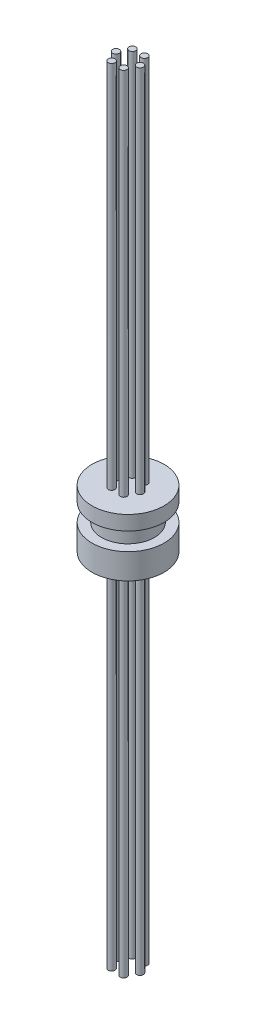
from build123d import *

# Parameters (mm, degrees)
CIRPATTERN1_COUNT = 6


with BuildPart() as part:
    # Sketch1 → Revolve1 (revolve)
    with BuildSketch(Plane.XY, mode=Mode.PRIVATE) as revolve1_sk:
        Polygon((-4.7625, -4.2672), (-4.7625, -7.62), (0, -7.62), (0, 0), (-4.7625, 0), (-4.7625, -1.905), (-3.4925, -1.905), (-3.4925, -4.2672), align=None)
    revolve(revolve1_sk.sketch.rotate(Axis((0, 0, 0), (0, 1, 0)), 270), axis=Axis((0, 0, 0), (0, 1, 0)))

    # Sketch2 → Revolve4 (revolve)
    with BuildSketch(Plane.XY, mode=Mode.PRIVATE) as revolve4_sk:
        Polygon((-1.778, -1.905), (-2.032, -1.905), (-2.032, 48.895), (-1.5875, 48.895), (-1.5875, -1.905), (-1.5875, -4.2672), (-1.5875, -55.0672), (-2.032, -55.0672), (-2.032, -4.2672), (-1.778, -4.2672), align=None)
    revolve4 = revolve(revolve4_sk.sketch.rotate(Axis((-1.5875, 0, 0), (0, 1, 0)), 180), axis=Axis((-1.5875, 0, 0), (0, 1, 0)))

    # CirPattern1: Revolve4 ×6 about axis
    cirpattern1_axis = Axis((0, 0, 0), (0, 1, 0))
    for i in range(1, CIRPATTERN1_COUNT):
        add(revolve4.rotate(cirpattern1_axis, i * 360 / CIRPATTERN1_COUNT))


solid = part.part
